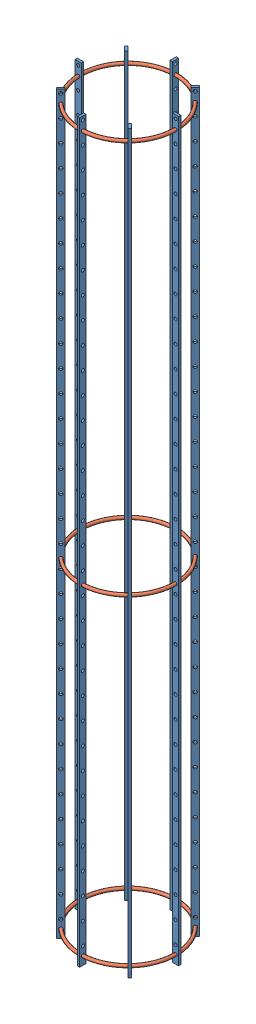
SolidWorks assembly ESTRUCTURA CENTRAL.SLDASM, configuration Predeterminado (file format 4400). Lengths in mm.
Overall size (282.84 1500 282.84).
11 component instances, 2 part files, 6 mates.
Components (placement in the parent):
- PLATINA DE ALUMINIO VERTICAL CENTRAL-1: PLATINA DE ALUMINIO VERTICAL CENTRAL.SLDPRT [Predeterminado] at (-90.5624 -1471.6765 4.8) x (0 0 -1) z (1 0 0) size (4.8 1500 12.7)
- VARILLA DE  1-4-1: VARILLA DE  1-4.SLDPRT [Predeterminado] at (-0.0624 2.3235 0) size (200 26.12 200)
- PLATINA DE ALUMINIO VERTICAL CENTRAL-9: PLATINA DE ALUMINIO VERTICAL CENTRAL.SLDPRT [Predeterminado] at (-60.6614 -1471.6765 67.3873) x (-0.707107 0 -0.707107) z (0.707107 0 -0.707107) size (4.8 1500 12.7)
- PLATINA DE ALUMINIO VERTICAL CENTRAL-10: PLATINA DE ALUMINIO VERTICAL CENTRAL.SLDPRT [Predeterminado] at (4.7376 -1471.6765 90.5) x (-1 0 0) z (0 0 -1) size (4.8 1500 12.7)
- PLATINA DE ALUMINIO VERTICAL CENTRAL-11: PLATINA DE ALUMINIO VERTICAL CENTRAL.SLDPRT [Predeterminado] at (67.3249 -1471.6765 60.5991) x (-0.707107 0 0.707107) z (-0.707107 0 -0.707107) size (4.8 1500 12.7)
- PLATINA DE ALUMINIO VERTICAL CENTRAL-12: PLATINA DE ALUMINIO VERTICAL CENTRAL.SLDPRT [Predeterminado] at (90.4376 -1471.6765 -4.8) x (0 0 1) z (-1 0 0) size (4.8 1500 12.7)
- PLATINA DE ALUMINIO VERTICAL CENTRAL-13: PLATINA DE ALUMINIO VERTICAL CENTRAL.SLDPRT [Predeterminado] at (60.5367 -1471.6765 -67.3873) x (0.707107 0 0.707107) z (-0.707107 0 0.707107) size (4.8 1500 12.7)
- PLATINA DE ALUMINIO VERTICAL CENTRAL-14: PLATINA DE ALUMINIO VERTICAL CENTRAL.SLDPRT [Predeterminado] at (-4.8624 -1471.6765 -90.5) size (4.8 1500 12.7)
- PLATINA DE ALUMINIO VERTICAL CENTRAL-15: PLATINA DE ALUMINIO VERTICAL CENTRAL.SLDPRT [Predeterminado] at (-67.4497 -1471.6765 -60.5991) x (0.707107 0 -0.707107) z (0.707107 0 0.707107) size (4.8 1500 12.7)
- VARILLA DE  1-4-2: VARILLA DE  1-4.SLDPRT [Predeterminado] at (-0.0624 -1454.5265 0) x (0.707107 0 -0.707107) z (0.707107 0 0.707107) size (200 26.12 200)
- VARILLA DE  1-4-3: VARILLA DE  1-4.SLDPRT [Predeterminado] at (-0.0624 -799.6765 0) x (0.707107 0 -0.707107) z (0.707107 0 0.707107) size (200 26.12 200)
Mates (geometry in assembly coordinates):
- Coincidente11: coincident anti-aligned: circle of VARILLA DE  1-4-1; circle of PLATINA DE ALUMINIO VERTICAL CENTRAL-1
- Paralelo2: parallel anti-aligned: line of VARILLA DE  1-4-1 through (-0.0624 -12.0793 0) axis (0 1 0); line of PLATINA DE ALUMINIO VERTICAL CENTRAL-1 through (-90.5624 28.3235 0) axis (0 -1 0)
- Coincidente17: coincident aligned: line of VARILLA DE  1-4-1 through (-0.0624 -12.0793 0) axis (0 1 0); line of VARILLA DE  1-4-2 through (-0.0624 -1468.9293 0) axis (0 1 0)
- Concéntrica15: concentric anti-aligned: cylinder of PLATINA DE ALUMINIO VERTICAL CENTRAL-9 through (-65.1516 -1454.5265 71.8774) axis (-0.707107 0 -0.707107) radius 3.15; circle of VARILLA DE  1-4-2
- Coincidente18: coincident aligned: line of VARILLA DE  1-4-1 through (-0.0624 -12.0793 0) axis (0 1 0); line of VARILLA DE  1-4-3 through (-0.0624 -814.0793 0) axis (0 1 0)
- Concéntrica16: concentric anti-aligned: cylinder of PLATINA DE ALUMINIO VERTICAL CENTRAL-9 through (-65.1516 -799.6765 71.8774) axis (-0.707107 0 -0.707107) radius 3.15; circle of VARILLA DE  1-4-3
